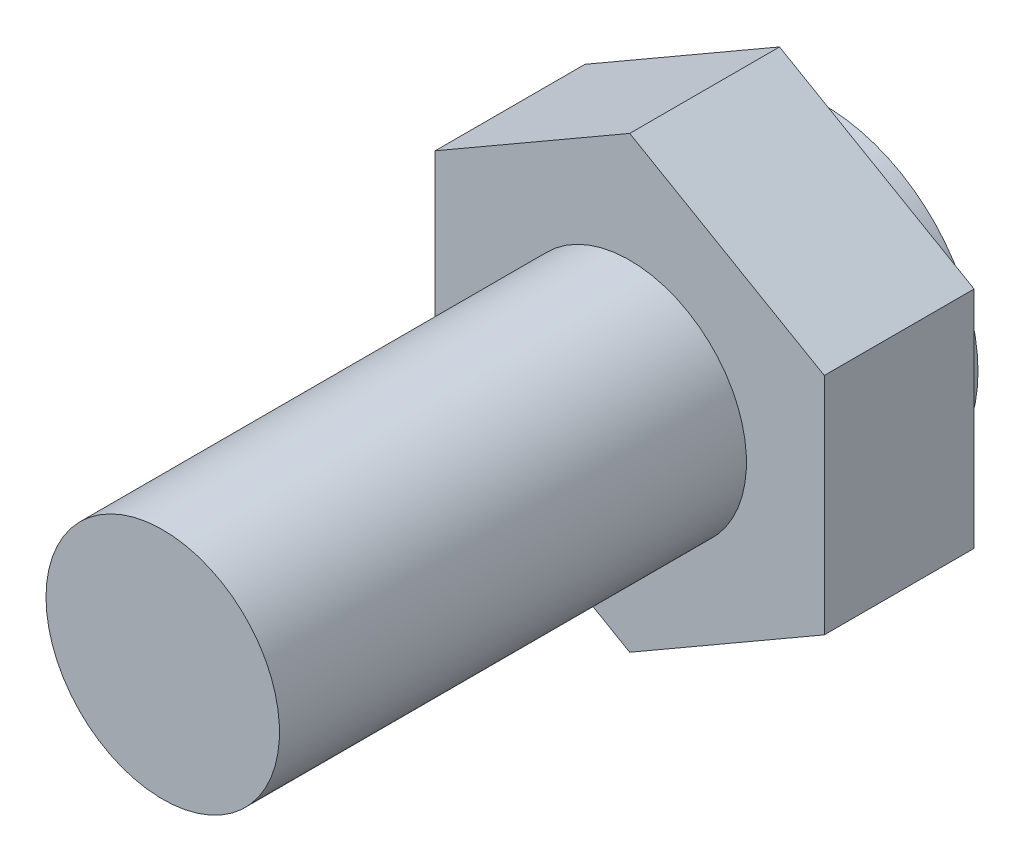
ISO-10303-21;
HEADER;
FILE_DESCRIPTION(('STEP AP214'),'2;1');
FILE_NAME('part.step','',(''),(''),'','','');
FILE_SCHEMA(('AUTOMOTIVE_DESIGN { 1 0 10303 214 1 1 1 1 }'));
ENDSEC;
DATA;
#1=APPLICATION_CONTEXT('core data for automotive mechanical design processes');
#2=APPLICATION_PROTOCOL_DEFINITION('international standard','automotive_design',2000,#1);
#3=PRODUCT_CONTEXT('',#1,'mechanical');
#4=PRODUCT('Part','Part','',(#3));
#5=PRODUCT_RELATED_PRODUCT_CATEGORY('part','',(#4));
#6=PRODUCT_DEFINITION_FORMATION('','',#4);
#7=PRODUCT_DEFINITION_CONTEXT('part definition',#1,'design');
#8=PRODUCT_DEFINITION('design','',#6,#7);
#9=PRODUCT_DEFINITION_SHAPE('','',#8);
#10=(LENGTH_UNIT() NAMED_UNIT(*) SI_UNIT(.MILLI.,.METRE.));
#11=(NAMED_UNIT(*) PLANE_ANGLE_UNIT() SI_UNIT($,.RADIAN.));
#12=(NAMED_UNIT(*) SI_UNIT($,.STERADIAN.) SOLID_ANGLE_UNIT());
#13=UNCERTAINTY_MEASURE_WITH_UNIT(LENGTH_MEASURE(1.E-05),#10,'distance_accuracy_value','');
#14=(GEOMETRIC_REPRESENTATION_CONTEXT(3) GLOBAL_UNCERTAINTY_ASSIGNED_CONTEXT((#13)) GLOBAL_UNIT_ASSIGNED_CONTEXT((#10,
#11,#12)) REPRESENTATION_CONTEXT('',''));
#15=CARTESIAN_POINT('',(0.,0.,0.));
#16=DIRECTION('',(0.,0.,1.));
#17=DIRECTION('',(1.,0.,0.));
#18=AXIS2_PLACEMENT_3D('',#15,#16,#17);
#19=CARTESIAN_POINT('',(0.,0.,17.));
#20=DIRECTION('',(0.,0.,-1.));
#21=DIRECTION('',(-1.,0.,0.));
#22=AXIS2_PLACEMENT_3D('',#19,#20,#21);
#23=PLANE('',#22);
#24=CARTESIAN_POINT('',(0.,0.,17.));
#25=DIRECTION('',(0.,0.,-1.));
#26=DIRECTION('',(-1.,0.,0.));
#27=AXIS2_PLACEMENT_3D('',#24,#25,#26);
#28=CIRCLE('',#27,3.);
#29=CARTESIAN_POINT('',(-3.,0.,17.));
#30=VERTEX_POINT('',#29);
#31=EDGE_CURVE('E21',#30,#30,#28,.T.);
#32=ORIENTED_EDGE('',*,*,#31,.F.);
#33=EDGE_LOOP('',(#32));
#34=FACE_BOUND('',#33,.T.);
#35=ADVANCED_FACE('F14',(#34),#23,.F.);
#36=CARTESIAN_POINT('',(0.,0.,-53.));
#37=DIRECTION('',(0.,0.,-1.));
#38=DIRECTION('',(-1.,0.,0.));
#39=AXIS2_PLACEMENT_3D('',#36,#37,#38);
#40=CYLINDRICAL_SURFACE('',#39,3.);
#41=CARTESIAN_POINT('',(0.,0.,5.));
#42=DIRECTION('',(0.,0.,-1.));
#43=DIRECTION('',(-1.,0.,0.));
#44=AXIS2_PLACEMENT_3D('',#41,#42,#43);
#45=CIRCLE('',#44,3.);
#46=CARTESIAN_POINT('',(-3.,0.,5.));
#47=VERTEX_POINT('',#46);
#48=EDGE_CURVE('E109',#47,#47,#45,.T.);
#49=ORIENTED_EDGE('',*,*,#48,.F.);
#50=EDGE_LOOP('',(#49));
#51=FACE_BOUND('',#50,.T.);
#52=ORIENTED_EDGE('',*,*,#31,.T.);
#53=EDGE_LOOP('',(#52));
#54=FACE_BOUND('',#53,.T.);
#55=ADVANCED_FACE('F153',(#51,#54),#40,.T.);
#56=CARTESIAN_POINT('',(-3.,0.,5.));
#57=DIRECTION('',(0.,0.,-1.));
#58=DIRECTION('',(-1.,0.,0.));
#59=AXIS2_PLACEMENT_3D('',#56,#57,#58);
#60=PLANE('',#59);
#61=DIRECTION('',(0.866025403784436,-0.5,0.));
#62=VECTOR('',#61,1.);
#63=CARTESIAN_POINT('',(0.270322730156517,5.66436512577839,5.));
#64=LINE('',#63,#62);
#65=CARTESIAN_POINT('',(0.,5.82043602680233,5.));
#66=VERTEX_POINT('',#65);
#67=CARTESIAN_POINT('',(5.,2.93368468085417,5.));
#68=VERTEX_POINT('',#67);
#69=EDGE_CURVE('E80',#66,#68,#64,.T.);
#70=ORIENTED_EDGE('',*,*,#69,.F.);
#71=DIRECTION('',(-0.866025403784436,-0.5,0.));
#72=VECTOR('',#71,1.);
#73=CARTESIAN_POINT('',(-4.77032273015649,3.06628891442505,5.));
#74=LINE('',#73,#72);
#75=CARTESIAN_POINT('',(-5.,2.93368468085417,5.));
#76=VERTEX_POINT('',#75);
#77=EDGE_CURVE('E106',#66,#76,#74,.T.);
#78=ORIENTED_EDGE('',*,*,#77,.T.);
#79=DIRECTION('',(0.,-1.,0.));
#80=VECTOR('',#79,1.);
#81=CARTESIAN_POINT('',(-5.,0.,5.));
#82=LINE('',#81,#80);
#83=CARTESIAN_POINT('',(-5.,-2.83981801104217,5.));
#84=VERTEX_POINT('',#83);
#85=EDGE_CURVE('E103',#76,#84,#82,.T.);
#86=ORIENTED_EDGE('',*,*,#85,.T.);
#87=DIRECTION('',(-0.866025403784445,0.49999999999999,0.));
#88=VECTOR('',#87,1.);
#89=CARTESIAN_POINT('',(-4.72967726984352,-2.99588891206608,5.));
#90=LINE('',#89,#88);
#91=CARTESIAN_POINT('',(0.,-5.72656935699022,5.));
#92=VERTEX_POINT('',#91);
#93=EDGE_CURVE('E101',#92,#84,#90,.T.);
#94=ORIENTED_EDGE('',*,*,#93,.F.);
#95=DIRECTION('',(0.866025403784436,0.5,0.));
#96=VECTOR('',#95,1.);
#97=CARTESIAN_POINT('',(0.229677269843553,-5.59396512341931,5.));
#98=LINE('',#97,#96);
#99=CARTESIAN_POINT('',(5.,-2.83981801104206,5.));
#100=VERTEX_POINT('',#99);
#101=EDGE_CURVE('E98',#92,#100,#98,.T.);
#102=ORIENTED_EDGE('',*,*,#101,.T.);
#103=DIRECTION('',(0.,-1.,0.));
#104=VECTOR('',#103,1.);
#105=CARTESIAN_POINT('',(5.,0.,5.));
#106=LINE('',#105,#104);
#107=EDGE_CURVE('E96',#68,#100,#106,.T.);
#108=ORIENTED_EDGE('',*,*,#107,.F.);
#109=EDGE_LOOP('',(#70,#78,#86,#94,#102,#108));
#110=FACE_BOUND('',#109,.T.);
#111=ORIENTED_EDGE('',*,*,#48,.T.);
#112=EDGE_LOOP('',(#111));
#113=FACE_BOUND('',#112,.T.);
#114=ADVANCED_FACE('F135',(#110,#113),#60,.F.);
#115=CARTESIAN_POINT('',(0.,5.82043602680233,10.));
#116=DIRECTION('',(0.5,-0.866025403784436,0.));
#117=DIRECTION('',(-0.866025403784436,-0.5,0.));
#118=AXIS2_PLACEMENT_3D('',#115,#116,#117);
#119=PLANE('',#118);
#120=DIRECTION('',(0.,0.,-1.));
#121=VECTOR('',#120,1.);
#122=CARTESIAN_POINT('',(0.,5.82043602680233,10.));
#123=LINE('',#122,#121);
#124=CARTESIAN_POINT('',(0.,5.82043602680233,1.15));
#125=VERTEX_POINT('',#124);
#126=EDGE_CURVE('E34',#66,#125,#123,.T.);
#127=ORIENTED_EDGE('',*,*,#126,.T.);
#128=DIRECTION('',(-0.866025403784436,-0.5,0.));
#129=VECTOR('',#128,1.);
#130=CARTESIAN_POINT('',(0.,5.82043602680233,1.15));
#131=LINE('',#130,#129);
#132=CARTESIAN_POINT('',(-5.,2.93368468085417,1.15));
#133=VERTEX_POINT('',#132);
#134=EDGE_CURVE('E27',#125,#133,#131,.T.);
#135=ORIENTED_EDGE('',*,*,#134,.T.);
#136=DIRECTION('',(0.,0.,-1.));
#137=VECTOR('',#136,1.);
#138=CARTESIAN_POINT('',(-5.,2.93368468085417,10.));
#139=LINE('',#138,#137);
#140=EDGE_CURVE('E92',#76,#133,#139,.T.);
#141=ORIENTED_EDGE('',*,*,#140,.F.);
#142=ORIENTED_EDGE('',*,*,#77,.F.);
#143=EDGE_LOOP('',(#127,#135,#141,#142));
#144=FACE_BOUND('',#143,.T.);
#145=ADVANCED_FACE('F129',(#144),#119,.F.);
#146=CARTESIAN_POINT('',(-5.,2.93368468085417,10.));
#147=DIRECTION('',(1.,0.,0.));
#148=DIRECTION('',(0.,-1.,0.));
#149=AXIS2_PLACEMENT_3D('',#146,#147,#148);
#150=PLANE('',#149);
#151=ORIENTED_EDGE('',*,*,#140,.T.);
#152=DIRECTION('',(0.,-1.,0.));
#153=VECTOR('',#152,1.);
#154=CARTESIAN_POINT('',(-5.,2.93368468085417,1.15));
#155=LINE('',#154,#153);
#156=CARTESIAN_POINT('',(-5.,-2.83981801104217,1.15));
#157=VERTEX_POINT('',#156);
#158=EDGE_CURVE('E125',#133,#157,#155,.T.);
#159=ORIENTED_EDGE('',*,*,#158,.T.);
#160=DIRECTION('',(0.,0.,-1.));
#161=VECTOR('',#160,1.);
#162=CARTESIAN_POINT('',(-5.,-2.83981801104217,10.));
#163=LINE('',#162,#161);
#164=EDGE_CURVE('E89',#84,#157,#163,.T.);
#165=ORIENTED_EDGE('',*,*,#164,.F.);
#166=ORIENTED_EDGE('',*,*,#85,.F.);
#167=EDGE_LOOP('',(#151,#159,#165,#166));
#168=FACE_BOUND('',#167,.T.);
#169=ADVANCED_FACE('F131',(#168),#150,.F.);
#170=CARTESIAN_POINT('',(0.,-5.72656935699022,10.));
#171=DIRECTION('',(-0.49999999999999,-0.866025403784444,0.));
#172=DIRECTION('',(-0.866025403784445,0.49999999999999,0.));
#173=AXIS2_PLACEMENT_3D('',#170,#171,#172);
#174=PLANE('',#173);
#175=DIRECTION('',(-0.866025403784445,0.49999999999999,0.));
#176=VECTOR('',#175,1.);
#177=CARTESIAN_POINT('',(0.,-5.72656935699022,1.15));
#178=LINE('',#177,#176);
#179=CARTESIAN_POINT('',(0.,-5.72656935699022,1.15));
#180=VERTEX_POINT('',#179);
#181=EDGE_CURVE('E123',#180,#157,#178,.T.);
#182=ORIENTED_EDGE('',*,*,#181,.F.);
#183=DIRECTION('',(0.,0.,-1.));
#184=VECTOR('',#183,1.);
#185=CARTESIAN_POINT('',(0.,-5.72656935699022,10.));
#186=LINE('',#185,#184);
#187=EDGE_CURVE('E82',#92,#180,#186,.T.);
#188=ORIENTED_EDGE('',*,*,#187,.F.);
#189=ORIENTED_EDGE('',*,*,#93,.T.);
#190=ORIENTED_EDGE('',*,*,#164,.T.);
#191=EDGE_LOOP('',(#182,#188,#189,#190));
#192=FACE_BOUND('',#191,.T.);
#193=ADVANCED_FACE('F142',(#192),#174,.T.);
#194=CARTESIAN_POINT('',(0.,-5.72656935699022,10.));
#195=DIRECTION('',(-0.5,0.866025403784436,0.));
#196=DIRECTION('',(0.866025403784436,0.5,0.));
#197=AXIS2_PLACEMENT_3D('',#194,#195,#196);
#198=PLANE('',#197);
#199=ORIENTED_EDGE('',*,*,#187,.T.);
#200=DIRECTION('',(0.866025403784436,0.5,0.));
#201=VECTOR('',#200,1.);
#202=CARTESIAN_POINT('',(0.,-5.72656935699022,1.15));
#203=LINE('',#202,#201);
#204=CARTESIAN_POINT('',(5.,-2.83981801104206,1.15));
#205=VERTEX_POINT('',#204);
#206=EDGE_CURVE('E75',#180,#205,#203,.T.);
#207=ORIENTED_EDGE('',*,*,#206,.T.);
#208=DIRECTION('',(0.,0.,-1.));
#209=VECTOR('',#208,1.);
#210=CARTESIAN_POINT('',(5.,-2.83981801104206,10.));
#211=LINE('',#210,#209);
#212=EDGE_CURVE('E74',#100,#205,#211,.T.);
#213=ORIENTED_EDGE('',*,*,#212,.F.);
#214=ORIENTED_EDGE('',*,*,#101,.F.);
#215=EDGE_LOOP('',(#199,#207,#213,#214));
#216=FACE_BOUND('',#215,.T.);
#217=ADVANCED_FACE('F138',(#216),#198,.F.);
#218=CARTESIAN_POINT('',(5.,2.93368468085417,10.));
#219=DIRECTION('',(1.,0.,0.));
#220=DIRECTION('',(0.,-1.,0.));
#221=AXIS2_PLACEMENT_3D('',#218,#219,#220);
#222=PLANE('',#221);
#223=DIRECTION('',(0.,-1.,0.));
#224=VECTOR('',#223,1.);
#225=CARTESIAN_POINT('',(5.,2.93368468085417,1.15));
#226=LINE('',#225,#224);
#227=CARTESIAN_POINT('',(5.,2.93368468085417,1.15));
#228=VERTEX_POINT('',#227);
#229=EDGE_CURVE('E64',#228,#205,#226,.T.);
#230=ORIENTED_EDGE('',*,*,#229,.F.);
#231=DIRECTION('',(0.,0.,-1.));
#232=VECTOR('',#231,1.);
#233=CARTESIAN_POINT('',(5.,2.93368468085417,10.));
#234=LINE('',#233,#232);
#235=EDGE_CURVE('E71',#68,#228,#234,.T.);
#236=ORIENTED_EDGE('',*,*,#235,.F.);
#237=ORIENTED_EDGE('',*,*,#107,.T.);
#238=ORIENTED_EDGE('',*,*,#212,.T.);
#239=EDGE_LOOP('',(#230,#236,#237,#238));
#240=FACE_BOUND('',#239,.T.);
#241=ADVANCED_FACE('F70',(#240),#222,.T.);
#242=CARTESIAN_POINT('',(0.,5.82043602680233,10.));
#243=DIRECTION('',(0.5,0.866025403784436,0.));
#244=DIRECTION('',(0.866025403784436,-0.5,0.));
#245=AXIS2_PLACEMENT_3D('',#242,#243,#244);
#246=PLANE('',#245);
#247=DIRECTION('',(0.866025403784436,-0.5,0.));
#248=VECTOR('',#247,1.);
#249=CARTESIAN_POINT('',(0.,5.82043602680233,1.15));
#250=LINE('',#249,#248);
#251=EDGE_CURVE('E9',#125,#228,#250,.T.);
#252=ORIENTED_EDGE('',*,*,#251,.F.);
#253=ORIENTED_EDGE('',*,*,#126,.F.);
#254=ORIENTED_EDGE('',*,*,#69,.T.);
#255=ORIENTED_EDGE('',*,*,#235,.T.);
#256=EDGE_LOOP('',(#252,#253,#254,#255));
#257=FACE_BOUND('',#256,.T.);
#258=ADVANCED_FACE('F78',(#257),#246,.T.);
#259=CARTESIAN_POINT('',(0.,10.,1.15));
#260=DIRECTION('',(0.,0.,1.));
#261=DIRECTION('',(1.,0.,0.));
#262=AXIS2_PLACEMENT_3D('',#259,#260,#261);
#263=PLANE('',#262);
#264=CARTESIAN_POINT('',(0.,0.,1.15));
#265=DIRECTION('',(0.,0.,-1.));
#266=DIRECTION('',(-1.,0.,0.));
#267=AXIS2_PLACEMENT_3D('',#264,#265,#266);
#268=CIRCLE('',#267,3.95);
#269=CARTESIAN_POINT('',(-3.95,0.,1.15));
#270=VERTEX_POINT('',#269);
#271=EDGE_CURVE('E114',#270,#270,#268,.T.);
#272=ORIENTED_EDGE('',*,*,#271,.F.);
#273=EDGE_LOOP('',(#272));
#274=FACE_BOUND('',#273,.T.);
#275=ORIENTED_EDGE('',*,*,#251,.T.);
#276=ORIENTED_EDGE('',*,*,#229,.T.);
#277=ORIENTED_EDGE('',*,*,#206,.F.);
#278=ORIENTED_EDGE('',*,*,#181,.T.);
#279=ORIENTED_EDGE('',*,*,#158,.F.);
#280=ORIENTED_EDGE('',*,*,#134,.F.);
#281=EDGE_LOOP('',(#275,#276,#277,#278,#279,#280));
#282=FACE_BOUND('',#281,.T.);
#283=ADVANCED_FACE('F63',(#274,#282),#263,.F.);
#284=CARTESIAN_POINT('',(0.,0.,-23.));
#285=DIRECTION('',(0.,0.,-1.));
#286=DIRECTION('',(-1.,0.,0.));
#287=AXIS2_PLACEMENT_3D('',#284,#285,#286);
#288=CYLINDRICAL_SURFACE('',#287,3.95);
#289=ORIENTED_EDGE('',*,*,#271,.T.);
#290=EDGE_LOOP('',(#289));
#291=FACE_BOUND('',#290,.T.);
#292=CARTESIAN_POINT('',(0.,0.,0.));
#293=DIRECTION('',(0.,0.,1.));
#294=DIRECTION('',(1.,0.,0.));
#295=AXIS2_PLACEMENT_3D('',#292,#293,#294);
#296=CIRCLE('',#295,3.95);
#297=CARTESIAN_POINT('',(3.95,0.,0.));
#298=VERTEX_POINT('',#297);
#299=EDGE_CURVE('E76',#298,#298,#296,.T.);
#300=ORIENTED_EDGE('',*,*,#299,.T.);
#301=EDGE_LOOP('',(#300));
#302=FACE_BOUND('',#301,.T.);
#303=ADVANCED_FACE('F169',(#291,#302),#288,.T.);
#304=CARTESIAN_POINT('',(-6.,0.,0.));
#305=DIRECTION('',(0.,0.,1.));
#306=DIRECTION('',(1.,0.,0.));
#307=AXIS2_PLACEMENT_3D('',#304,#305,#306);
#308=PLANE('',#307);
#309=ORIENTED_EDGE('',*,*,#299,.F.);
#310=EDGE_LOOP('',(#309));
#311=FACE_BOUND('',#310,.T.);
#312=ADVANCED_FACE('F167',(#311),#308,.F.);
#313=CLOSED_SHELL('',(#35,#55,#114,#145,#169,#193,#217,#241,#258,#283,#303,#312));
#314=MANIFOLD_SOLID_BREP('B1',#313);
#315=ADVANCED_BREP_SHAPE_REPRESENTATION('',(#18,#314),#14);
#316=SHAPE_DEFINITION_REPRESENTATION(#9,#315);
ENDSEC;
END-ISO-10303-21;
